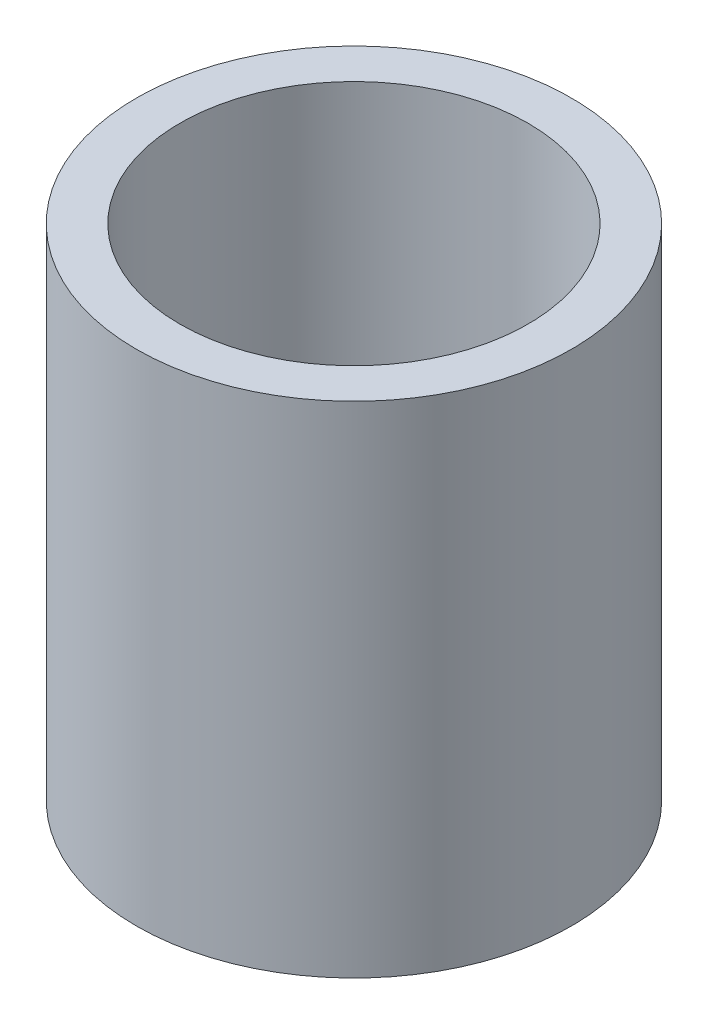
from build123d import *

# Parameters (mm, degrees)
SKETCH1_R      = 57.5
SKETCH1_R_2    = 46
EXTRUDE1_DEPTH = 132


with BuildPart() as part:
    # Sketch1 → Extrude1 (new body)
    with BuildSketch(Plane(origin=(0, 0, 0), x_dir=(1, 0, 0), z_dir=(0, 1, 0))):
        with Locations(Location((0, 0, 0), (0, 0, 270))):
            Circle(SKETCH1_R)
        with Locations(Location((0, 0, 0), (0, 0, 270))):
            Circle(SKETCH1_R_2, mode=Mode.SUBTRACT)
    extrude(amount=EXTRUDE1_DEPTH)


solid = part.part
